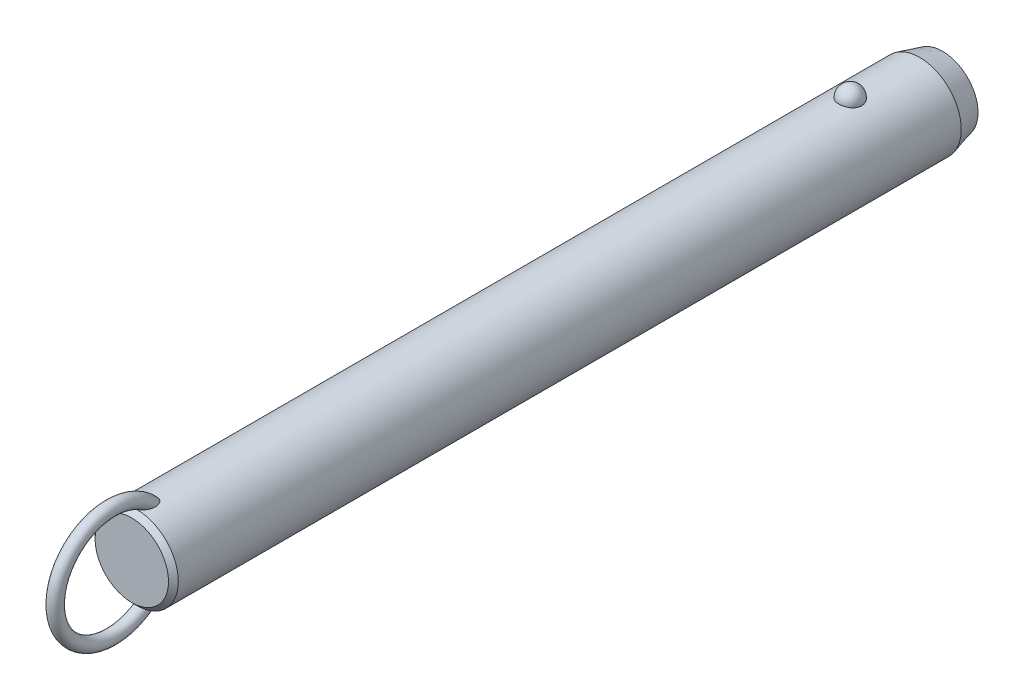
ISO-10303-21;
HEADER;
FILE_DESCRIPTION(('STEP AP214'),'2;1');
FILE_NAME('part.step','',(''),(''),'','','');
FILE_SCHEMA(('AUTOMOTIVE_DESIGN { 1 0 10303 214 1 1 1 1 }'));
ENDSEC;
DATA;
#1=APPLICATION_CONTEXT('core data for automotive mechanical design processes');
#2=APPLICATION_PROTOCOL_DEFINITION('international standard','automotive_design',2000,#1);
#3=PRODUCT_CONTEXT('',#1,'mechanical');
#4=PRODUCT('Part','Part','',(#3));
#5=PRODUCT_RELATED_PRODUCT_CATEGORY('part','',(#4));
#6=PRODUCT_DEFINITION_FORMATION('','',#4);
#7=PRODUCT_DEFINITION_CONTEXT('part definition',#1,'design');
#8=PRODUCT_DEFINITION('design','',#6,#7);
#9=PRODUCT_DEFINITION_SHAPE('','',#8);
#10=(LENGTH_UNIT() NAMED_UNIT(*) SI_UNIT(.MILLI.,.METRE.));
#11=(NAMED_UNIT(*) PLANE_ANGLE_UNIT() SI_UNIT($,.RADIAN.));
#12=(NAMED_UNIT(*) SI_UNIT($,.STERADIAN.) SOLID_ANGLE_UNIT());
#13=UNCERTAINTY_MEASURE_WITH_UNIT(LENGTH_MEASURE(1.E-05),#10,'distance_accuracy_value','');
#14=(GEOMETRIC_REPRESENTATION_CONTEXT(3) GLOBAL_UNCERTAINTY_ASSIGNED_CONTEXT((#13)) GLOBAL_UNIT_ASSIGNED_CONTEXT((#10,
#11,#12)) REPRESENTATION_CONTEXT('',''));
#15=CARTESIAN_POINT('',(0.,0.,0.));
#16=DIRECTION('',(0.,0.,1.));
#17=DIRECTION('',(1.,0.,0.));
#18=AXIS2_PLACEMENT_3D('',#15,#16,#17);
#19=CARTESIAN_POINT('',(0.,0.,203.2));
#20=DIRECTION('',(0.,0.,-1.));
#21=DIRECTION('',(-1.,0.,0.));
#22=AXIS2_PLACEMENT_3D('',#19,#20,#21);
#23=CYLINDRICAL_SURFACE('',#22,12.7);
#24=CARTESIAN_POINT('',(3.46661256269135,12.2177165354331,-3.50000000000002));
#25=CARTESIAN_POINT('',(3.4666090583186,12.2177194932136,-3.30432790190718));
#26=CARTESIAN_POINT('',(3.45063567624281,12.2222841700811,-3.10861112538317));
#27=CARTESIAN_POINT('',(3.38712451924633,12.2400345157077,-2.72271899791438));
#28=CARTESIAN_POINT('',(3.33957415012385,12.2532236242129,-2.53254588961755));
#29=CARTESIAN_POINT('',(3.2141234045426,12.286724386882,-2.16324948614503));
#30=CARTESIAN_POINT('',(3.13623639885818,12.3070329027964,-1.98412136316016));
#31=CARTESIAN_POINT('',(2.95205930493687,12.3525018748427,-1.6418059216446));
#32=CARTESIAN_POINT('',(2.84577003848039,12.3776621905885,-1.47861814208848));
#33=CARTESIAN_POINT('',(2.60688050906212,12.4301712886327,-1.17190583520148));
#34=CARTESIAN_POINT('',(2.47415697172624,12.4575299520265,-1.0284789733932));
#35=CARTESIAN_POINT('',(2.18615174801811,12.5112810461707,-0.766177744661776));
#36=CARTESIAN_POINT('',(2.03087002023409,12.5376734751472,-0.647303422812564));
#37=CARTESIAN_POINT('',(1.70237334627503,12.5864761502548,-0.437732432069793));
#38=CARTESIAN_POINT('',(1.52920948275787,12.6088972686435,-0.346958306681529));
#39=CARTESIAN_POINT('',(1.16944170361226,12.6473352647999,-0.195750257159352));
#40=CARTESIAN_POINT('',(0.982839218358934,12.663352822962,-0.135313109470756));
#41=CARTESIAN_POINT('',(0.604961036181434,12.6869706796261,-0.0473241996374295));
#42=CARTESIAN_POINT('',(0.41382314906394,12.6947125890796,-0.0192185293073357));
#43=CARTESIAN_POINT('',(0.0293827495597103,12.7014203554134,0.00517254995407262));
#44=CARTESIAN_POINT('',(-0.163919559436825,12.7003870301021,0.00146092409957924));
#45=CARTESIAN_POINT('',(-0.544374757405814,12.689735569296,-0.0373939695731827));
#46=CARTESIAN_POINT('',(-0.731575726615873,12.6802364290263,-0.0721015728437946));
#47=CARTESIAN_POINT('',(-1.09733277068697,12.6538333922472,-0.171364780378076));
#48=CARTESIAN_POINT('',(-1.27588869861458,12.6369293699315,-0.235920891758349));
#49=CARTESIAN_POINT('',(-1.6204698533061,12.5973946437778,-0.393548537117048));
#50=CARTESIAN_POINT('',(-1.78641865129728,12.5747321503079,-0.486778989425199));
#51=CARTESIAN_POINT('',(-2.10030671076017,12.5261316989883,-0.699110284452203));
#52=CARTESIAN_POINT('',(-2.24824419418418,12.5001934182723,-0.818213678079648));
#53=CARTESIAN_POINT('',(-2.52491489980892,12.4472906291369,-1.0815712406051));
#54=CARTESIAN_POINT('',(-2.65324222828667,12.4203160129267,-1.22624992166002));
#55=CARTESIAN_POINT('',(-2.88410007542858,12.3687509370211,-1.53528325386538));
#56=CARTESIAN_POINT('',(-2.98662883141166,12.3441606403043,-1.69963924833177));
#57=CARTESIAN_POINT('',(-3.16432417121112,12.2998199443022,-2.04548497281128));
#58=CARTESIAN_POINT('',(-3.23917525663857,12.2801261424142,-2.22714424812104));
#59=CARTESIAN_POINT('',(-3.35800573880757,12.248167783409,-2.60091389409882));
#60=CARTESIAN_POINT('',(-3.4019860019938,12.2359030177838,-2.79302397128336));
#61=CARTESIAN_POINT('',(-3.45784812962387,12.2202347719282,-3.18140279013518));
#62=CARTESIAN_POINT('',(-3.46986123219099,12.2167950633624,-3.37765118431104));
#63=CARTESIAN_POINT('',(-3.46186273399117,12.2190638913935,-3.76943689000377));
#64=CARTESIAN_POINT('',(-3.44185196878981,12.2247721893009,-3.96497421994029));
#65=CARTESIAN_POINT('',(-3.37048652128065,12.2446381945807,-4.34881728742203));
#66=CARTESIAN_POINT('',(-3.31928253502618,12.2587552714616,-4.53715319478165));
#67=CARTESIAN_POINT('',(-3.18693461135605,12.2938237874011,-4.9023172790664));
#68=CARTESIAN_POINT('',(-3.1057895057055,12.3147754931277,-5.07914500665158));
#69=CARTESIAN_POINT('',(-2.91506431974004,12.3613125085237,-5.41732059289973));
#70=CARTESIAN_POINT('',(-2.80533587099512,12.3869217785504,-5.57858147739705));
#71=CARTESIAN_POINT('',(-2.560414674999,12.4398525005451,-5.88013283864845));
#72=CARTESIAN_POINT('',(-2.42522099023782,12.4671740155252,-6.02042254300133));
#73=CARTESIAN_POINT('',(-2.1323357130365,12.5205965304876,-6.27662798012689));
#74=CARTESIAN_POINT('',(-1.97456596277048,12.5466928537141,-6.39245542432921));
#75=CARTESIAN_POINT('',(-1.64115839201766,12.5946384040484,-6.59583547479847));
#76=CARTESIAN_POINT('',(-1.46552179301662,12.6164879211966,-6.68339001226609));
#77=CARTESIAN_POINT('',(-1.10356050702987,12.6532533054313,-6.82682153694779));
#78=CARTESIAN_POINT('',(-0.9173913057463,12.6682500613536,-6.88306988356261));
#79=CARTESIAN_POINT('',(-0.537836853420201,12.6900288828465,-6.96386887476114));
#80=CARTESIAN_POINT('',(-0.344452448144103,12.6968119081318,-6.98842322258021));
#81=CARTESIAN_POINT('',(0.0402577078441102,12.7013667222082,-7.00496469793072));
#82=CARTESIAN_POINT('',(0.231556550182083,12.6993008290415,-6.99753844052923));
#83=CARTESIAN_POINT('',(0.610105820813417,12.6867505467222,-6.95166366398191));
#84=CARTESIAN_POINT('',(0.797356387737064,12.6762664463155,-6.91321620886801));
#85=CARTESIAN_POINT('',(1.16186657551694,12.6480587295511,-6.80658431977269));
#86=CARTESIAN_POINT('',(1.33915951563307,12.6303611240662,-6.73850666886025));
#87=CARTESIAN_POINT('',(1.67968518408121,12.5896027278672,-6.57450875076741));
#88=CARTESIAN_POINT('',(1.84291705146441,12.5665416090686,-6.47858678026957));
#89=CARTESIAN_POINT('',(2.15340192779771,12.5171072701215,-6.25982455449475));
#90=CARTESIAN_POINT('',(2.30037831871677,12.4906895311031,-6.13660186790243));
#91=CARTESIAN_POINT('',(2.5717412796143,12.4376567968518,-5.86739587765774));
#92=CARTESIAN_POINT('',(2.69612388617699,12.4110417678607,-5.72140858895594));
#93=CARTESIAN_POINT('',(2.92107785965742,12.360051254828,-5.40794137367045));
#94=CARTESIAN_POINT('',(3.02121329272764,12.3357209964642,-5.24014110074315));
#95=CARTESIAN_POINT('',(3.19236291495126,12.2925446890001,-4.88969865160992));
#96=CARTESIAN_POINT('',(3.26338839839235,12.2736965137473,-4.70706226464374));
#97=CARTESIAN_POINT('',(3.36788038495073,12.245404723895,-4.35469510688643));
#98=CARTESIAN_POINT('',(3.40484026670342,12.2351018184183,-4.18605935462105));
#99=CARTESIAN_POINT('',(3.45420764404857,12.2212564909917,-3.84496058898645));
#100=CARTESIAN_POINT('',(3.46661565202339,12.2177139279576,-3.67249765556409));
#101=CARTESIAN_POINT('',(3.46661256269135,12.2177165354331,-3.50000000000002));
#102=B_SPLINE_CURVE_WITH_KNOTS('',3,(#24,#25,#26,#27,#28,#29,#30,#31,#32,#33,#34,#35,#36,#37,
#38,#39,#40,#41,#42,#43,#44,#45,#46,#47,#48,#49,#50,#51,#52,#53,#54,#55,#56,#57,#58,#59,#60,#61,
#62,#63,#64,#65,#66,#67,#68,#69,#70,#71,#72,#73,#74,#75,#76,#77,#78,#79,#80,#81,#82,#83,#84,#85,
#86,#87,#88,#89,#90,#91,#92,#93,#94,#95,#96,#97,#98,#99,#100,#101),.UNSPECIFIED.,.T.,.F.,(4,2,2,
2,2,2,2,2,2,2,2,2,2,2,2,2,2,2,2,2,2,2,2,2,2,2,2,2,2,2,2,2,2,2,2,2,2,2,4),(0.,0.586396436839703,
1.17302689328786,1.7593990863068,2.34575431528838,2.93491084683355,3.52406845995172,
4.11158733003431,4.69904375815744,5.2762784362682,5.85345931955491,6.42265312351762,
6.99185659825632,7.56427334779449,8.136746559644,8.71981013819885,9.3029135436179,
9.89247258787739,10.4820150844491,11.0691335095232,11.6562366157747,12.2405256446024,
12.8248374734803,13.412244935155,13.9996740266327,14.5891883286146,15.1786623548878,
15.7609861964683,16.3432419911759,16.9148635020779,17.4864654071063,18.0560241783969,
18.6256177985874,19.2037609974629,19.7820055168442,20.3699810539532,20.957728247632,
21.4746855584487,21.9916320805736),.UNSPECIFIED.);
#103=CARTESIAN_POINT('',(3.46661256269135,12.2177165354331,-3.50000000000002));
#104=VERTEX_POINT('',#103);
#105=EDGE_CURVE('E41',#104,#104,#102,.T.);
#106=ORIENTED_EDGE('',*,*,#105,.T.);
#107=EDGE_LOOP('',(#106));
#108=FACE_BOUND('',#107,.T.);
#109=CARTESIAN_POINT('',(0.,0.,214.4));
#110=DIRECTION('',(0.,0.,1.));
#111=DIRECTION('',(1.,0.,0.));
#112=AXIS2_PLACEMENT_3D('',#109,#110,#111);
#113=CIRCLE('',#112,12.7);
#114=CARTESIAN_POINT('',(12.7,0.,214.4));
#115=VERTEX_POINT('',#114);
#116=EDGE_CURVE('E10',#115,#115,#113,.F.);
#117=ORIENTED_EDGE('',*,*,#116,.T.);
#118=EDGE_LOOP('',(#117));
#119=FACE_BOUND('',#118,.T.);
#120=CARTESIAN_POINT('',(-0.548122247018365,-12.6881662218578,208.143218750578));
#121=CARTESIAN_POINT('',(-0.648865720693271,-12.6838128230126,208.177926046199));
#122=CARTESIAN_POINT('',(-0.746398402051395,-12.6783867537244,208.222042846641));
#123=CARTESIAN_POINT('',(-0.932125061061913,-12.666091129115,208.326764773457));
#124=CARTESIAN_POINT('',(-1.02030388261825,-12.6592192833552,208.387396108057));
#125=CARTESIAN_POINT('',(-1.18487740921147,-12.6448747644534,208.521847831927));
#126=CARTESIAN_POINT('',(-1.26134296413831,-12.637406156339,208.595582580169));
#127=CARTESIAN_POINT('',(-1.4023120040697,-12.6225412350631,208.753604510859));
#128=CARTESIAN_POINT('',(-1.466814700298,-12.6151449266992,208.83789238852));
#129=CARTESIAN_POINT('',(-1.60714786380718,-12.5981718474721,209.049657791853));
#130=CARTESIAN_POINT('',(-1.67725126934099,-12.588900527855,209.180962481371));
#131=CARTESIAN_POINT('',(-1.79536591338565,-12.5725964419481,209.453247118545));
#132=CARTESIAN_POINT('',(-1.84333535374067,-12.5655679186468,209.594244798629));
#133=CARTESIAN_POINT('',(-1.93422576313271,-12.5519624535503,209.937645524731));
#134=CARTESIAN_POINT('',(-1.96788773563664,-12.5466298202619,210.142557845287));
#135=CARTESIAN_POINT('',(-1.9941399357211,-12.542463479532,210.451760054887));
#136=CARTESIAN_POINT('',(-1.99883864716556,-12.5417153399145,210.555298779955));
#137=CARTESIAN_POINT('',(-2.00078003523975,-12.5414074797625,210.76245124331));
#138=CARTESIAN_POINT('',(-1.99802449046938,-12.5418474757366,210.866064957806));
#139=CARTESIAN_POINT('',(-1.98336733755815,-12.5441750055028,211.11032076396));
#140=CARTESIAN_POINT('',(-1.96851430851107,-12.5465291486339,211.250780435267));
#141=CARTESIAN_POINT('',(-1.92707089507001,-12.5529612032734,211.529960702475));
#142=CARTESIAN_POINT('',(-1.90047458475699,-12.5570399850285,211.668680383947));
#143=CARTESIAN_POINT('',(-1.8361912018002,-12.5666008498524,211.94341135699));
#144=CARTESIAN_POINT('',(-1.79850828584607,-12.57208240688,212.079423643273));
#145=CARTESIAN_POINT('',(-1.71223796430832,-12.5841228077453,212.347842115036));
#146=CARTESIAN_POINT('',(-1.66365679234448,-12.5906810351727,212.480250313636));
#147=CARTESIAN_POINT('',(-1.5780450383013,-12.6016176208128,212.68548877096));
#148=CARTESIAN_POINT('',(-1.54477252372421,-12.6057501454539,212.759914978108));
#149=CARTESIAN_POINT('',(-1.47424480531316,-12.6141930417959,212.906839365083));
#150=CARTESIAN_POINT('',(-1.436990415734,-12.6185033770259,212.979337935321));
#151=CARTESIAN_POINT('',(-1.35825795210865,-12.6272207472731,213.121892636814));
#152=CARTESIAN_POINT('',(-1.31678520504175,-12.6316276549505,213.191951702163));
#153=CARTESIAN_POINT('',(-1.22917793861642,-12.6404532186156,213.329070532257));
#154=CARTESIAN_POINT('',(-1.18304514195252,-12.6448718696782,213.396131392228));
#155=CARTESIAN_POINT('',(-1.0724641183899,-12.6547893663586,213.543874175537));
#156=CARTESIAN_POINT('',(-1.0064223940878,-12.6602600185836,213.623384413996));
#157=CARTESIAN_POINT('',(-0.864441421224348,-12.6707460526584,213.773169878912));
#158=CARTESIAN_POINT('',(-0.788516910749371,-12.6757620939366,213.843458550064));
#159=CARTESIAN_POINT('',(-0.652215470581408,-12.6833591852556,213.948680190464));
#160=CARTESIAN_POINT('',(-0.594982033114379,-12.6861973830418,213.987624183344));
#161=CARTESIAN_POINT('',(-0.475269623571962,-12.6912445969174,214.056489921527));
#162=CARTESIAN_POINT('',(-0.412800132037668,-12.6934547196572,214.086427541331));
#163=CARTESIAN_POINT('',(-0.29574972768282,-12.6966636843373,214.12975652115));
#164=CARTESIAN_POINT('',(-0.241949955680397,-12.6978134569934,214.145218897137));
#165=CARTESIAN_POINT('',(-0.132508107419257,-12.6994261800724,214.166884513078));
#166=CARTESIAN_POINT('',(-0.0768679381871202,-12.6998898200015,214.173097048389));
#167=CARTESIAN_POINT('',(0.0347696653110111,-12.7000752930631,214.175583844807));
#168=CARTESIAN_POINT('',(0.0907676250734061,-12.6997954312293,214.171835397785));
#169=CARTESIAN_POINT('',(0.201283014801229,-12.6985255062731,214.154788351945));
#170=CARTESIAN_POINT('',(0.255799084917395,-12.6975348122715,214.141481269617));
#171=CARTESIAN_POINT('',(0.376042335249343,-12.6946091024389,214.10203792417));
#172=CARTESIAN_POINT('',(0.440950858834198,-12.6924943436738,214.073449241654));
#173=CARTESIAN_POINT('',(0.56535027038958,-12.6875639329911,214.006323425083));
#174=CARTESIAN_POINT('',(0.624828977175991,-12.6847467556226,213.967764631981));
#175=CARTESIAN_POINT('',(0.774116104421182,-12.6767252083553,213.856949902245));
#176=CARTESIAN_POINT('',(0.859449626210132,-12.6711344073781,213.778760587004));
#177=CARTESIAN_POINT('',(1.01789440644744,-12.6593922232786,213.610943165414));
#178=CARTESIAN_POINT('',(1.09096902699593,-12.653239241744,213.521282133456));
#179=CARTESIAN_POINT('',(1.22268793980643,-12.6411674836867,213.340265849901));
#180=CARTESIAN_POINT('',(1.28193986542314,-12.6352572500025,213.249345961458));
#181=CARTESIAN_POINT('',(1.39259777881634,-12.6235401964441,213.062792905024));
#182=CARTESIAN_POINT('',(1.44399707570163,-12.6177334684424,212.967155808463));
#183=CARTESIAN_POINT('',(1.53972870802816,-12.6064093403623,212.772273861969));
#184=CARTESIAN_POINT('',(1.58405262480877,-12.6008922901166,212.673024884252));
#185=CARTESIAN_POINT('',(1.66600705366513,-12.5903187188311,212.471772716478));
#186=CARTESIAN_POINT('',(1.70363651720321,-12.5852622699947,212.369769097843));
#187=CARTESIAN_POINT('',(1.77545379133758,-12.5753406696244,212.154358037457));
#188=CARTESIAN_POINT('',(1.80903453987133,-12.5705328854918,212.040745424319));
#189=CARTESIAN_POINT('',(1.86844163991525,-12.5618400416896,211.811457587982));
#190=CARTESIAN_POINT('',(1.89426665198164,-12.5579551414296,211.695782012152));
#191=CARTESIAN_POINT('',(1.9378546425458,-12.5513030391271,211.463007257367));
#192=CARTESIAN_POINT('',(1.95562640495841,-12.5485346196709,211.345909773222));
#193=CARTESIAN_POINT('',(1.98264463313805,-12.5442934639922,211.110747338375));
#194=CARTESIAN_POINT('',(1.99189298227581,-12.5428204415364,210.99268260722));
#195=CARTESIAN_POINT('',(2.00416068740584,-12.540871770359,210.680622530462));
#196=CARTESIAN_POINT('',(1.99944433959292,-12.541631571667,210.486229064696));
#197=CARTESIAN_POINT('',(1.96113755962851,-12.5476846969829,210.100309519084));
#198=CARTESIAN_POINT('',(1.92758341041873,-12.5529723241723,209.908780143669));
#199=CARTESIAN_POINT('',(1.83934342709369,-12.5661532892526,209.582272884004));
#200=CARTESIAN_POINT('',(1.79215440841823,-12.5730485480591,209.44524997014));
#201=CARTESIAN_POINT('',(1.67676242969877,-12.588958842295,209.180445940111));
#202=CARTESIAN_POINT('',(1.60859050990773,-12.597970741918,209.052651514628));
#203=CARTESIAN_POINT('',(1.46583832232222,-12.6152829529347,208.835800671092));
#204=CARTESIAN_POINT('',(1.39525727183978,-12.6233659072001,208.74410500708));
#205=CARTESIAN_POINT('',(1.23992594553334,-12.6395676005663,208.573485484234));
#206=CARTESIAN_POINT('',(1.15517932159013,-12.6476863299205,208.494558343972));
#207=CARTESIAN_POINT('',(0.971995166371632,-12.6630846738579,208.352643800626));
#208=CARTESIAN_POINT('',(0.873456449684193,-12.6703572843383,208.289784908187));
#209=CARTESIAN_POINT('',(0.665847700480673,-12.6829569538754,208.184487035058));
#210=CARTESIAN_POINT('',(0.556784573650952,-12.688285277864,208.142034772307));
#211=CARTESIAN_POINT('',(0.347338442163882,-12.6956226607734,208.084443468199));
#212=CARTESIAN_POINT('',(0.247759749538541,-12.6979816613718,208.066399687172));
#213=CARTESIAN_POINT('',(0.0470218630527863,-12.7003077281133,208.048600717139));
#214=CARTESIAN_POINT('',(-0.0541350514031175,-12.7002779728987,208.048821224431));
#215=CARTESIAN_POINT('',(-0.22141402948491,-12.6982482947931,208.064363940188));
#216=CARTESIAN_POINT('',(-0.288055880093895,-12.6969033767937,208.074666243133));
#217=CARTESIAN_POINT('',(-0.419599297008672,-12.6932369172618,208.10313489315));
#218=CARTESIAN_POINT('',(-0.484501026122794,-12.6909154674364,208.121300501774));
#219=CARTESIAN_POINT('',(-0.548122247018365,-12.6881662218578,208.143218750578));
#220=B_SPLINE_CURVE_WITH_KNOTS('',3,(#120,#121,#122,#123,#124,#125,#126,#127,#128,#129,#130,
#131,#132,#133,#134,#135,#136,#137,#138,#139,#140,#141,#142,#143,#144,#145,#146,#147,#148,#149,
#150,#151,#152,#153,#154,#155,#156,#157,#158,#159,#160,#161,#162,#163,#164,#165,#166,#167,#168,
#169,#170,#171,#172,#173,#174,#175,#176,#177,#178,#179,#180,#181,#182,#183,#184,#185,#186,#187,
#188,#189,#190,#191,#192,#193,#194,#195,#196,#197,#198,#199,#200,#201,#202,#203,#204,#205,#206,
#207,#208,#209,#210,#211,#212,#213,#214,#215,#216,#217,#218,#219),.UNSPECIFIED.,.T.,.F.,(4,2,2,
2,2,2,2,2,2,2,2,2,2,2,2,2,2,2,2,2,2,2,2,2,2,2,2,2,2,2,2,2,2,2,2,2,2,2,2,2,2,2,2,2,2,2,2,2,2,4),
(0.,0.31964225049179,0.639794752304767,0.957927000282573,1.27608021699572,1.72100165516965,
2.16675988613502,2.78630021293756,3.09705782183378,3.40774128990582,3.8309635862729,
4.25439969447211,4.67767724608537,5.10071330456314,5.3455029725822,5.59024267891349,
5.83467707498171,6.07902143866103,6.38891080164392,6.69834321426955,6.9056091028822,
7.11250749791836,7.27977315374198,7.44687060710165,7.61434932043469,7.78197685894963,
7.99365544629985,8.20579780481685,8.55147335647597,8.89816429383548,9.22375138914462,
9.54961437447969,9.8758622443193,10.202161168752,10.557587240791,10.9130746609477,
11.2681734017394,11.6231936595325,12.2046601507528,12.7853961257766,13.219164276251,
13.6522938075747,13.9989174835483,14.3454519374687,14.6946768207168,15.0436740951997,
15.3457513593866,15.6474266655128,15.8493051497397,16.0511646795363),.UNSPECIFIED.);
#221=CARTESIAN_POINT('',(-0.548122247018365,-12.6881662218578,208.143218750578));
#222=VERTEX_POINT('',#221);
#223=EDGE_CURVE('E59',#222,#222,#220,.T.);
#224=ORIENTED_EDGE('',*,*,#223,.T.);
#225=EDGE_LOOP('',(#224));
#226=FACE_BOUND('',#225,.T.);
#227=CARTESIAN_POINT('',(-0.548122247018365,12.6881662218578,208.143218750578));
#228=CARTESIAN_POINT('',(-0.459436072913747,12.6919968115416,208.112673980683));
#229=CARTESIAN_POINT('',(-0.368189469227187,12.6949996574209,208.089391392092));
#230=CARTESIAN_POINT('',(-0.183024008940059,12.6990186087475,208.058406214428));
#231=CARTESIAN_POINT('',(-0.0891049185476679,12.7000345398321,208.050704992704));
#232=CARTESIAN_POINT('',(0.0987147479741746,12.6999636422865,208.051245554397));
#233=CARTESIAN_POINT('',(0.192615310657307,12.6988761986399,208.059492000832));
#234=CARTESIAN_POINT('',(0.377658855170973,12.6947211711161,208.091551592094));
#235=CARTESIAN_POINT('',(0.468801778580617,12.6916535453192,208.115365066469));
#236=CARTESIAN_POINT('',(0.645809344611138,12.6838788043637,208.17745651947));
#237=CARTESIAN_POINT('',(0.731679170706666,12.6791733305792,208.215720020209));
#238=CARTESIAN_POINT('',(0.896315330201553,12.6686004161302,208.305120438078));
#239=CARTESIAN_POINT('',(0.975080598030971,12.6627328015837,208.356259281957));
#240=CARTESIAN_POINT('',(1.12963655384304,12.6499161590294,208.47367820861));
#241=CARTESIAN_POINT('',(1.20478673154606,12.6429194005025,208.540792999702));
#242=CARTESIAN_POINT('',(1.34448241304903,12.6288282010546,208.68522507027));
#243=CARTESIAN_POINT('',(1.40902173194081,12.621733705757,208.762548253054));
#244=CARTESIAN_POINT('',(1.55208211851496,12.6050877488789,208.959247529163));
#245=CARTESIAN_POINT('',(1.62510490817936,12.5957546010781,209.082654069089));
#246=CARTESIAN_POINT('',(1.75019044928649,12.5789823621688,209.339769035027));
#247=CARTESIAN_POINT('',(1.8022137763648,12.5715468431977,209.473496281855));
#248=CARTESIAN_POINT('',(1.90309965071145,12.5567434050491,209.798351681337));
#249=CARTESIAN_POINT('',(1.94342317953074,12.5504515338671,209.992161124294));
#250=CARTESIAN_POINT('',(1.99332997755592,12.5426147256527,210.38378810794));
#251=CARTESIAN_POINT('',(2.00285305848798,12.5410790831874,210.581612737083));
#252=CARTESIAN_POINT('',(1.99678999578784,12.5420407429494,210.916642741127));
#253=CARTESIAN_POINT('',(1.98794117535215,12.5434564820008,211.054042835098));
#254=CARTESIAN_POINT('',(1.95865119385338,12.5480641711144,211.327639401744));
#255=CARTESIAN_POINT('',(1.93820436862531,12.5512569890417,211.463835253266));
#256=CARTESIAN_POINT('',(1.88647896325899,12.5591352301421,211.734249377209));
#257=CARTESIAN_POINT('',(1.85518800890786,12.5638223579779,211.868465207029));
#258=CARTESIAN_POINT('',(1.78217886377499,12.5743868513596,212.133936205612));
#259=CARTESIAN_POINT('',(1.74046509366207,12.5802637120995,212.265192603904));
#260=CARTESIAN_POINT('',(1.66024095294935,12.5910571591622,212.486085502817));
#261=CARTESIAN_POINT('',(1.62434772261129,12.5957535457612,212.576690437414));
#262=CARTESIAN_POINT('',(1.54709009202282,12.6054762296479,212.755512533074));
#263=CARTESIAN_POINT('',(1.50572681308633,12.6105024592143,212.843730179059));
#264=CARTESIAN_POINT('',(1.41728020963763,12.620748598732,213.016932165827));
#265=CARTESIAN_POINT('',(1.37021377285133,12.625967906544,213.101925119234));
#266=CARTESIAN_POINT('',(1.26969620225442,12.6364721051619,213.268007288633));
#267=CARTESIAN_POINT('',(1.21624929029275,12.6417569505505,213.349099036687));
#268=CARTESIAN_POINT('',(1.1030441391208,12.6521331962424,213.504702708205));
#269=CARTESIAN_POINT('',(1.04340936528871,12.657226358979,213.579303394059));
#270=CARTESIAN_POINT('',(0.915919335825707,12.667090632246,213.721324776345));
#271=CARTESIAN_POINT('',(0.848064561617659,12.6718617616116,213.78874589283));
#272=CARTESIAN_POINT('',(0.717035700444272,12.67987711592,213.900624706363));
#273=CARTESIAN_POINT('',(0.655526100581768,12.6832377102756,213.946997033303));
#274=CARTESIAN_POINT('',(0.525985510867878,12.6892676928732,214.029619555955));
#275=CARTESIAN_POINT('',(0.457969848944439,12.6919386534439,214.065892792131));
#276=CARTESIAN_POINT('',(0.334859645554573,12.695691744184,214.116657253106));
#277=CARTESIAN_POINT('',(0.281116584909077,12.6970073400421,214.134373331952));
#278=CARTESIAN_POINT('',(0.171425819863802,12.6989609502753,214.160642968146));
#279=CARTESIAN_POINT('',(0.115480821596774,12.699599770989,214.169207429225));
#280=CARTESIAN_POINT('',(0.00272618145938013,12.7001251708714,214.176253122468));
#281=CARTESIAN_POINT('',(-0.0540859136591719,12.7000089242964,214.174696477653));
#282=CARTESIAN_POINT('',(-0.16654462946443,12.6990328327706,214.161600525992));
#283=CARTESIAN_POINT('',(-0.222190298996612,12.6981724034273,214.150053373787));
#284=CARTESIAN_POINT('',(-0.342018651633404,12.695562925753,214.114912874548));
#285=CARTESIAN_POINT('',(-0.405606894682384,12.6936676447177,214.08933225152));
#286=CARTESIAN_POINT('',(-0.527815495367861,12.6891754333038,214.028311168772));
#287=CARTESIAN_POINT('',(-0.586425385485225,12.6865770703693,213.992850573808));
#288=CARTESIAN_POINT('',(-0.731842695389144,12.6792129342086,213.891496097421));
#289=CARTESIAN_POINT('',(-0.814709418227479,12.6740767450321,213.8200395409));
#290=CARTESIAN_POINT('',(-0.969101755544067,12.6632083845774,213.66589007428));
#291=CARTESIAN_POINT('',(-1.04059564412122,12.6574746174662,213.583166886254));
#292=CARTESIAN_POINT('',(-1.16981116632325,12.6461638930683,213.415809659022));
#293=CARTESIAN_POINT('',(-1.22811369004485,12.6405994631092,213.331616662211));
#294=CARTESIAN_POINT('',(-1.33743405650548,12.6295007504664,213.158579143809));
#295=CARTESIAN_POINT('',(-1.38844577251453,12.6239664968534,213.069730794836));
#296=CARTESIAN_POINT('',(-1.48400702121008,12.6130898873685,212.888389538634));
#297=CARTESIAN_POINT('',(-1.52854232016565,12.6077479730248,212.795889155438));
#298=CARTESIAN_POINT('',(-1.61150113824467,12.5974127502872,212.608160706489));
#299=CARTESIAN_POINT('',(-1.64992317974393,12.5924195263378,212.512931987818));
#300=CARTESIAN_POINT('',(-1.73468589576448,12.581070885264,212.28289362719));
#301=CARTESIAN_POINT('',(-1.77831261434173,12.5749388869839,212.147066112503));
#302=CARTESIAN_POINT('',(-1.85439734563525,12.5639437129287,211.872212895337));
#303=CARTESIAN_POINT('',(-1.88684994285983,12.5590811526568,211.733185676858));
#304=CARTESIAN_POINT('',(-1.94008483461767,12.550968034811,211.45309235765));
#305=CARTESIAN_POINT('',(-1.96088706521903,12.5477147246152,211.312030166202));
#306=CARTESIAN_POINT('',(-1.99000539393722,12.5431291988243,211.028668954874));
#307=CARTESIAN_POINT('',(-1.99832911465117,12.5417958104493,210.886370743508));
#308=CARTESIAN_POINT('',(-2.00166624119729,12.5412674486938,210.557627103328));
#309=CARTESIAN_POINT('',(-1.99178843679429,12.5428579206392,210.371088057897));
#310=CARTESIAN_POINT('',(-1.94455183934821,12.5502731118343,210.00162404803));
#311=CARTESIAN_POINT('',(-1.90724032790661,12.5560905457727,209.818693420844));
#312=CARTESIAN_POINT('',(-1.81330718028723,12.5699462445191,209.504848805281));
#313=CARTESIAN_POINT('',(-1.76338820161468,12.5771273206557,209.371910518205));
#314=CARTESIAN_POINT('',(-1.64305018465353,12.593414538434,209.115681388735));
#315=CARTESIAN_POINT('',(-1.57265346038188,12.6025185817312,208.992380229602));
#316=CARTESIAN_POINT('',(-1.42634956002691,12.6198178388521,208.783564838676));
#317=CARTESIAN_POINT('',(-1.35423772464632,12.6278405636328,208.695384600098));
#318=CARTESIAN_POINT('',(-1.19645664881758,12.6437632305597,208.532107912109));
#319=CARTESIAN_POINT('',(-1.1108053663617,12.6516633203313,208.456994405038));
#320=CARTESIAN_POINT('',(-0.94721936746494,12.6648319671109,208.337811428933));
#321=CARTESIAN_POINT('',(-0.871624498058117,12.670300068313,208.290541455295));
#322=CARTESIAN_POINT('',(-0.714161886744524,12.6801492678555,208.2077413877));
#323=CARTESIAN_POINT('',(-0.632295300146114,12.684530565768,208.17220913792));
#324=CARTESIAN_POINT('',(-0.548122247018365,12.6881662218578,208.143218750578));
#325=B_SPLINE_CURVE_WITH_KNOTS('',3,(#227,#228,#229,#230,#231,#232,#233,#234,#235,#236,#237,
#238,#239,#240,#241,#242,#243,#244,#245,#246,#247,#248,#249,#250,#251,#252,#253,#254,#255,#256,
#257,#258,#259,#260,#261,#262,#263,#264,#265,#266,#267,#268,#269,#270,#271,#272,#273,#274,#275,
#276,#277,#278,#279,#280,#281,#282,#283,#284,#285,#286,#287,#288,#289,#290,#291,#292,#293,#294,
#295,#296,#297,#298,#299,#300,#301,#302,#303,#304,#305,#306,#307,#308,#309,#310,#311,#312,#313,
#314,#315,#316,#317,#318,#319,#320,#321,#322,#323,#324),.UNSPECIFIED.,.T.,.F.,(4,2,2,2,2,2,2,2,
2,2,2,2,2,2,2,2,2,2,2,2,2,2,2,2,2,2,2,2,2,2,2,2,2,2,2,2,2,2,2,2,2,2,2,2,2,2,2,2,4),(0.,
0.281328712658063,0.562682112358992,0.844117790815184,1.12555942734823,1.40671982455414,
1.68792232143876,1.98972294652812,2.29169886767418,2.72039860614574,3.14989948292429,
3.74084916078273,4.33295293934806,4.74554109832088,5.15833092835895,5.57159335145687,
5.98468079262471,6.27722775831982,6.56971484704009,6.86135609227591,7.15280542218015,
7.43927407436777,7.72572595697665,7.95635862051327,8.18646071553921,8.35559393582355,
8.52452541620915,8.69408946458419,8.86378678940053,9.06834348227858,9.27332014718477,
9.60010414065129,9.92778432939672,10.2350252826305,10.5425229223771,10.8506864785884,
11.15892440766,11.5867893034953,12.0148612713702,12.4421984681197,12.8692745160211,
13.4279365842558,13.9856380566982,14.4107062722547,14.835313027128,15.1765567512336,
15.517351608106,15.7844129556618,16.051425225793),.UNSPECIFIED.);
#326=CARTESIAN_POINT('',(-0.548122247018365,12.6881662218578,208.143218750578));
#327=VERTEX_POINT('',#326);
#328=EDGE_CURVE('E67',#327,#327,#325,.T.);
#329=ORIENTED_EDGE('',*,*,#328,.T.);
#330=EDGE_LOOP('',(#329));
#331=FACE_BOUND('',#330,.T.);
#332=CARTESIAN_POINT('',(0.,0.,-24.6999999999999));
#333=DIRECTION('',(0.,0.,-1.));
#334=DIRECTION('',(-1.,0.,0.));
#335=AXIS2_PLACEMENT_3D('',#332,#333,#334);
#336=CIRCLE('',#335,12.7);
#337=CARTESIAN_POINT('',(-12.7,0.,-24.6999999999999));
#338=VERTEX_POINT('',#337);
#339=EDGE_CURVE('E56',#338,#338,#336,.F.);
#340=ORIENTED_EDGE('',*,*,#339,.T.);
#341=EDGE_LOOP('',(#340));
#342=FACE_BOUND('',#341,.T.);
#343=ADVANCED_FACE('F37',(#108,#119,#226,#331,#342),#23,.T.);
#344=CARTESIAN_POINT('',(0.,0.,-31.7));
#345=DIRECTION('',(0.,0.,-1.));
#346=DIRECTION('',(-1.,0.,0.));
#347=AXIS2_PLACEMENT_3D('',#344,#345,#346);
#348=PLANE('',#347);
#349=CARTESIAN_POINT('',(0.,0.,-31.7));
#350=DIRECTION('',(0.,0.,-1.));
#351=DIRECTION('',(-1.,0.,0.));
#352=AXIS2_PLACEMENT_3D('',#349,#350,#351);
#353=CIRCLE('',#352,10.8243556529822);
#354=CARTESIAN_POINT('',(-10.8243556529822,0.,-31.7));
#355=VERTEX_POINT('',#354);
#356=EDGE_CURVE('E66',#355,#355,#353,.T.);
#357=ORIENTED_EDGE('',*,*,#356,.T.);
#358=EDGE_LOOP('',(#357));
#359=FACE_BOUND('',#358,.T.);
#360=ADVANCED_FACE('F85',(#359),#348,.T.);
#361=CARTESIAN_POINT('',(0.,0.,-31.7));
#362=DIRECTION('',(0.,0.,1.));
#363=DIRECTION('',(1.,0.,0.));
#364=AXIS2_PLACEMENT_3D('',#361,#362,#363);
#365=CONICAL_SURFACE('',#364,10.8243556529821,0.261799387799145);
#366=ORIENTED_EDGE('',*,*,#339,.F.);
#367=EDGE_LOOP('',(#366));
#368=FACE_BOUND('',#367,.T.);
#369=ORIENTED_EDGE('',*,*,#356,.F.);
#370=EDGE_LOOP('',(#369));
#371=FACE_BOUND('',#370,.T.);
#372=ADVANCED_FACE('F83',(#368,#371),#365,.T.);
#373=CARTESIAN_POINT('',(0.,0.,215.9));
#374=DIRECTION('',(0.,0.,1.));
#375=DIRECTION('',(1.,0.,0.));
#376=AXIS2_PLACEMENT_3D('',#373,#374,#375);
#377=PLANE('',#376);
#378=CARTESIAN_POINT('',(0.,0.,215.9));
#379=DIRECTION('',(0.,0.,1.));
#380=DIRECTION('',(1.,0.,0.));
#381=AXIS2_PLACEMENT_3D('',#378,#379,#380);
#382=CIRCLE('',#381,11.2);
#383=CARTESIAN_POINT('',(11.2,0.,215.9));
#384=VERTEX_POINT('',#383);
#385=EDGE_CURVE('E50',#384,#384,#382,.T.);
#386=ORIENTED_EDGE('',*,*,#385,.T.);
#387=EDGE_LOOP('',(#386));
#388=FACE_BOUND('',#387,.T.);
#389=ADVANCED_FACE('F77',(#388),#377,.T.);
#390=CARTESIAN_POINT('',(0.,0.,222.25));
#391=DIRECTION('',(1.,0.,0.));
#392=DIRECTION('',(0.,0.,-1.));
#393=AXIS2_PLACEMENT_3D('',#390,#391,#392);
#394=TOROIDAL_SURFACE('',#393,17.05,2.);
#395=ORIENTED_EDGE('',*,*,#328,.F.);
#396=EDGE_LOOP('',(#395));
#397=FACE_BOUND('',#396,.T.);
#398=ORIENTED_EDGE('',*,*,#223,.F.);
#399=EDGE_LOOP('',(#398));
#400=FACE_BOUND('',#399,.T.);
#401=ADVANCED_FACE('F73',(#397,#400),#394,.T.);
#402=CARTESIAN_POINT('',(0.,0.,215.9));
#403=DIRECTION('',(0.,0.,-1.));
#404=DIRECTION('',(-1.,0.,0.));
#405=AXIS2_PLACEMENT_3D('',#402,#403,#404);
#406=CONICAL_SURFACE('',#405,11.2,0.785398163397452);
#407=ORIENTED_EDGE('',*,*,#116,.F.);
#408=EDGE_LOOP('',(#407));
#409=FACE_BOUND('',#408,.T.);
#410=ORIENTED_EDGE('',*,*,#385,.F.);
#411=EDGE_LOOP('',(#410));
#412=FACE_BOUND('',#411,.T.);
#413=ADVANCED_FACE('F39',(#409,#412),#406,.T.);
#414=CARTESIAN_POINT('',(0.,12.7,-3.50000000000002));
#415=DIRECTION('',(0.,1.,0.));
#416=DIRECTION('',(0.,0.,-1.));
#417=AXIS2_PLACEMENT_3D('',#414,#415,#416);
#418=SPHERICAL_SURFACE('',#417,3.5);
#419=ORIENTED_EDGE('',*,*,#105,.F.);
#420=EDGE_LOOP('',(#419));
#421=FACE_BOUND('',#420,.T.);
#422=ADVANCED_FACE('F79',(#421),#418,.T.);
#423=CLOSED_SHELL('',(#343,#360,#372,#389,#401,#413,#422));
#424=MANIFOLD_SOLID_BREP('B2',#423);
#425=ADVANCED_BREP_SHAPE_REPRESENTATION('',(#18,#424),#14);
#426=SHAPE_DEFINITION_REPRESENTATION(#9,#425);
ENDSEC;
END-ISO-10303-21;
